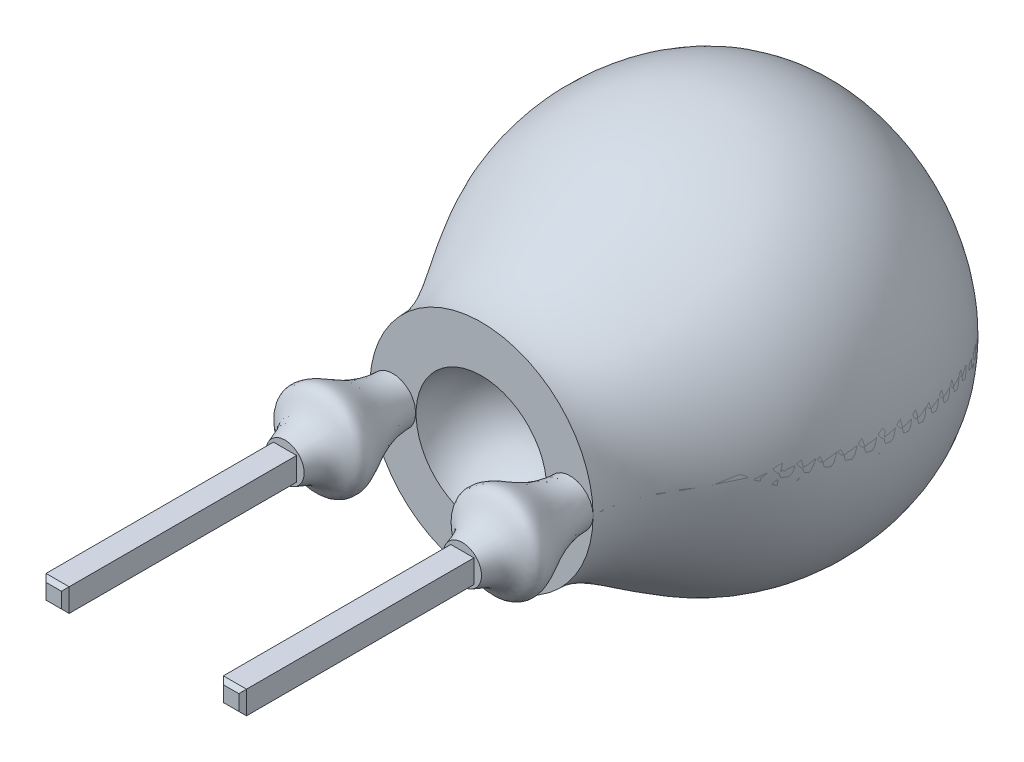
ISO-10303-21;
HEADER;
FILE_DESCRIPTION(('STEP AP214'),'2;1');
FILE_NAME('part.step','',(''),(''),'','','');
FILE_SCHEMA(('AUTOMOTIVE_DESIGN { 1 0 10303 214 1 1 1 1 }'));
ENDSEC;
DATA;
#1=APPLICATION_CONTEXT('core data for automotive mechanical design processes');
#2=APPLICATION_PROTOCOL_DEFINITION('international standard','automotive_design',2000,#1);
#3=PRODUCT_CONTEXT('',#1,'mechanical');
#4=PRODUCT('Part','Part','',(#3));
#5=PRODUCT_RELATED_PRODUCT_CATEGORY('part','',(#4));
#6=PRODUCT_DEFINITION_FORMATION('','',#4);
#7=PRODUCT_DEFINITION_CONTEXT('part definition',#1,'design');
#8=PRODUCT_DEFINITION('design','',#6,#7);
#9=PRODUCT_DEFINITION_SHAPE('','',#8);
#10=(LENGTH_UNIT() NAMED_UNIT(*) SI_UNIT(.MILLI.,.METRE.));
#11=(NAMED_UNIT(*) PLANE_ANGLE_UNIT() SI_UNIT($,.RADIAN.));
#12=(NAMED_UNIT(*) SI_UNIT($,.STERADIAN.) SOLID_ANGLE_UNIT());
#13=UNCERTAINTY_MEASURE_WITH_UNIT(LENGTH_MEASURE(1.E-05),#10,'distance_accuracy_value','');
#14=(GEOMETRIC_REPRESENTATION_CONTEXT(3) GLOBAL_UNCERTAINTY_ASSIGNED_CONTEXT((#13)) GLOBAL_UNIT_ASSIGNED_CONTEXT((#10,
#11,#12)) REPRESENTATION_CONTEXT('',''));
#15=CARTESIAN_POINT('',(0.,0.,0.));
#16=DIRECTION('',(0.,0.,1.));
#17=DIRECTION('',(1.,0.,0.));
#18=AXIS2_PLACEMENT_3D('',#15,#16,#17);
#19=CARTESIAN_POINT('',(0.,0.,-1.39695413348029));
#20=DIRECTION('',(0.,0.,1.));
#21=DIRECTION('',(1.,0.,0.));
#22=AXIS2_PLACEMENT_3D('',#19,#20,#21);
#23=SPHERICAL_SURFACE('',#22,0.847180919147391);
#24=CARTESIAN_POINT('',(0.,0.,-1.39695413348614));
#25=DIRECTION('',(0.,0.,1.));
#26=DIRECTION('',(1.,0.,0.));
#27=AXIS2_PLACEMENT_3D('',#24,#25,#26);
#28=CIRCLE('',#27,0.847180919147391);
#29=CARTESIAN_POINT('',(0.847180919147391,0.,-1.39695413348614));
#30=VERTEX_POINT('',#29);
#31=EDGE_CURVE('E12',#30,#30,#28,.T.);
#32=ORIENTED_EDGE('',*,*,#31,.T.);
#33=EDGE_LOOP('',(#32));
#34=FACE_BOUND('',#33,.T.);
#35=ADVANCED_FACE('F42',(#34),#23,.F.);
#36=CARTESIAN_POINT('',(0.847180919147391,0.,-1.39695413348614));
#37=DIRECTION('',(0.,0.,1.));
#38=DIRECTION('',(1.,0.,0.));
#39=AXIS2_PLACEMENT_3D('',#36,#37,#38);
#40=PLANE('',#39);
#41=CARTESIAN_POINT('',(0.,0.,-1.39695413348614));
#42=DIRECTION('',(0.,0.,1.));
#43=DIRECTION('',(1.,0.,0.));
#44=AXIS2_PLACEMENT_3D('',#41,#42,#43);
#45=CIRCLE('',#44,1.44772172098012);
#46=CARTESIAN_POINT('',(1.44772172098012,0.,-1.39695413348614));
#47=VERTEX_POINT('',#46);
#48=EDGE_CURVE('E48',#47,#47,#45,.T.);
#49=ORIENTED_EDGE('',*,*,#48,.T.);
#50=EDGE_LOOP('',(#49));
#51=FACE_BOUND('',#50,.T.);
#52=ORIENTED_EDGE('',*,*,#31,.F.);
#53=EDGE_LOOP('',(#52));
#54=FACE_BOUND('',#53,.T.);
#55=ADVANCED_FACE('F54',(#51,#54),#40,.T.);
#56=CARTESIAN_POINT('',(1.4477217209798,0.,-1.39695413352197));
#57=CARTESIAN_POINT('',(1.43940707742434,0.,-2.0445928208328));
#58=CARTESIAN_POINT('',(2.86556308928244,0.,-3.35387835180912));
#59=CARTESIAN_POINT('',(2.36238990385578,0.,-6.40949501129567));
#60=CARTESIAN_POINT('',(0.374661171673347,0.,-6.50548745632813));
#61=CARTESIAN_POINT('',(0.,0.,-6.33489721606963));
#62=B_SPLINE_CURVE_WITH_KNOTS('',3,(#56,#57,#58,#59,#60,#61),.UNSPECIFIED.,.F.,.F.,(4,1,1,4),
(0.186847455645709,0.431077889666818,0.786359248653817,1.0320571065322),.UNSPECIFIED.);
#63=CARTESIAN_POINT('',(0.,0.,0.));
#64=DIRECTION('',(0.,0.,1.));
#65=AXIS1_PLACEMENT('',#63,#64);
#66=SURFACE_OF_REVOLUTION('',#62,#65);
#67=CARTESIAN_POINT('',(0.,0.,-6.33489721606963));
#68=VERTEX_POINT('',#67);
#69=VERTEX_LOOP('',#68);
#70=FACE_BOUND('',#69,.T.);
#71=ORIENTED_EDGE('',*,*,#48,.F.);
#72=EDGE_LOOP('',(#71));
#73=FACE_BOUND('',#72,.T.);
#74=ADVANCED_FACE('F51',(#70,#73),#66,.F.);
#75=CLOSED_SHELL('',(#35,#55,#74));
#76=MANIFOLD_SOLID_BREP('B2',#75);
#77=CARTESIAN_POINT('',(1.39739232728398,0.,-0.000164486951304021));
#78=CARTESIAN_POINT('',(1.43186781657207,0.,-0.114042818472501));
#79=CARTESIAN_POINT('',(1.48500321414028,0.,-0.289557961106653));
#80=CARTESIAN_POINT('',(1.85338365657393,0.,-0.449633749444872));
#81=CARTESIAN_POINT('',(0.972106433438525,0.,-1.66585540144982));
#82=CARTESIAN_POINT('',(2.90090916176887,0.,-3.1392324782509));
#83=CARTESIAN_POINT('',(2.46196736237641,0.,-5.80479160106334));
#84=CARTESIAN_POINT('',(1.35485925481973,0.,-6.29118697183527));
#85=CARTESIAN_POINT('',(1.15000000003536,0.,-6.3482408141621));
#86=B_SPLINE_CURVE_WITH_KNOTS('',3,(#77,#78,#79,#80,#81,#82,#83,#84,#85),.UNSPECIFIED.,.F.,.F.,
(4,1,1,1,1,1,4),(0.,0.0420977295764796,0.0648831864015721,0.127474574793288,0.431077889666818,
0.786359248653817,0.864790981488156),.UNSPECIFIED.);
#87=CARTESIAN_POINT('',(1.15000000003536,0.,-0.000164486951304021));
#88=DIRECTION('',(0.,0.,1.));
#89=AXIS1_PLACEMENT('',#87,#88);
#90=SURFACE_OF_REVOLUTION('',#86,#89);
#91=CARTESIAN_POINT('',(0.,0.,-3.24089099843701));
#92=CARTESIAN_POINT('',(0.,0.0332385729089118,-3.24089929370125));
#93=CARTESIAN_POINT('',(0.,0.066534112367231,-3.24429590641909));
#94=CARTESIAN_POINT('',(0.,0.131868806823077,-3.25754081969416));
#95=CARTESIAN_POINT('',(0.,0.163903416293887,-3.26741053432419));
#96=CARTESIAN_POINT('',(0.,0.225373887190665,-3.29255072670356));
#97=CARTESIAN_POINT('',(0.,0.25483229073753,-3.30776689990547));
#98=CARTESIAN_POINT('',(0.,0.310993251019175,-3.34253675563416));
#99=CARTESIAN_POINT('',(0.,0.337695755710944,-3.36209052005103));
#100=CARTESIAN_POINT('',(0.,0.435671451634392,-3.44449524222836));
#101=CARTESIAN_POINT('',(2.72317212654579E-13,0.496703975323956,-3.51982001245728));
#102=CARTESIAN_POINT('',(1.15147209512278E-13,0.564038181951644,-3.62995706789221));
#103=CARTESIAN_POINT('',(0.,0.580315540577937,-3.65971767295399));
#104=CARTESIAN_POINT('',(0.,0.610232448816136,-3.72053435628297));
#105=CARTESIAN_POINT('',(0.,0.623876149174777,-3.75158830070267));
#106=CARTESIAN_POINT('',(0.,0.661049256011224,-3.84627869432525));
#107=CARTESIAN_POINT('',(0.,0.68079879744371,-3.91140658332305));
#108=CARTESIAN_POINT('',(0.,0.711355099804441,-4.04574418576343));
#109=CARTESIAN_POINT('',(0.,0.721872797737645,-4.11501778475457));
#110=CARTESIAN_POINT('',(0.,0.733282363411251,-4.25440514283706));
#111=CARTESIAN_POINT('',(0.,0.734165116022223,-4.3245196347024));
#112=CARTESIAN_POINT('',(0.,0.725410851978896,-4.4786207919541));
#113=CARTESIAN_POINT('',(0.,0.713571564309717,-4.56249286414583));
#114=CARTESIAN_POINT('',(0.,0.674908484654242,-4.72672491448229));
#115=CARTESIAN_POINT('',(0.,0.648113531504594,-4.80709133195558));
#116=CARTESIAN_POINT('',(0.,0.592090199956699,-4.92927130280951));
#117=CARTESIAN_POINT('',(0.,0.56822386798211,-4.97353701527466));
#118=CARTESIAN_POINT('',(0.,0.527691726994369,-5.03684634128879));
#119=CARTESIAN_POINT('',(0.,0.513404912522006,-5.05742008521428));
#120=CARTESIAN_POINT('',(0.,0.483178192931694,-5.09736407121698));
#121=CARTESIAN_POINT('',(2.04297004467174E-13,0.467235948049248,-5.11673254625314));
#122=CARTESIAN_POINT('',(2.85900495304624E-13,0.424510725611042,-5.1641442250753));
#123=CARTESIAN_POINT('',(0.,0.396557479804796,-5.19115712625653));
#124=CARTESIAN_POINT('',(0.,0.336716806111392,-5.24034320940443));
#125=CARTESIAN_POINT('',(0.,0.304838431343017,-5.26252721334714));
#126=CARTESIAN_POINT('',(0.,0.243807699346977,-5.29709874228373));
#127=CARTESIAN_POINT('',(0.,0.215256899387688,-5.31054189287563));
#128=CARTESIAN_POINT('',(0.,0.156311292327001,-5.33250137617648));
#129=CARTESIAN_POINT('',(0.,0.125917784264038,-5.3410211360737));
#130=CARTESIAN_POINT('',(0.,0.0639330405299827,-5.35254009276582));
#131=CARTESIAN_POINT('',(0.,0.0323367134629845,-5.35551233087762));
#132=CARTESIAN_POINT('',(0.,-0.0308629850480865,-5.35560179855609));
#133=CARTESIAN_POINT('',(0.,-0.0624663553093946,-5.35271968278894));
#134=CARTESIAN_POINT('',(0.,-0.122220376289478,-5.34179004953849));
#135=CARTESIAN_POINT('',(0.,-0.150449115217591,-5.33415891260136));
#136=CARTESIAN_POINT('',(0.,-0.205391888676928,-5.31461239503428));
#137=CARTESIAN_POINT('',(0.,-0.232104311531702,-5.30269255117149));
#138=CARTESIAN_POINT('',(0.,-0.291996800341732,-5.2706782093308));
#139=CARTESIAN_POINT('',(0.,-0.324429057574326,-5.24918496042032));
#140=CARTESIAN_POINT('',(0.,-0.385363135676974,-5.2012123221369));
#141=CARTESIAN_POINT('',(0.,-0.413857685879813,-5.17472391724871));
#142=CARTESIAN_POINT('',(0.,-0.47651062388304,-5.10766271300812));
#143=CARTESIAN_POINT('',(0.,-0.508938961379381,-5.06547843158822));
#144=CARTESIAN_POINT('',(0.,-0.566686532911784,-4.97652523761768));
#145=CARTESIAN_POINT('',(3.0412279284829E-13,-0.591993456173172,-4.92974857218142));
#146=CARTESIAN_POINT('',(4.07045563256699E-13,-0.644368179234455,-4.81487685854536));
#147=CARTESIAN_POINT('',(1.08987414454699E-13,-0.668461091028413,-4.74542699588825));
#148=CARTESIAN_POINT('',(-1.09475002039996E-13,-0.705229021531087,-4.60361391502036));
#149=CARTESIAN_POINT('',(0.,-0.717892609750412,-4.53124785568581));
#150=CARTESIAN_POINT('',(0.,-0.732640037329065,-4.38380614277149));
#151=CARTESIAN_POINT('',(0.,-0.734477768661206,-4.3087062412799));
#152=CARTESIAN_POINT('',(0.,-0.727116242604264,-4.15904143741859));
#153=CARTESIAN_POINT('',(0.,-0.717917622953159,-4.08447650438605));
#154=CARTESIAN_POINT('',(0.,-0.689360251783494,-3.94348659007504));
#155=CARTESIAN_POINT('',(0.,-0.670869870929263,-3.87688655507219));
#156=CARTESIAN_POINT('',(0.,-0.623616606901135,-3.74740411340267));
#157=CARTESIAN_POINT('',(0.,-0.594868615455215,-3.6845164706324));
#158=CARTESIAN_POINT('',(0.,-0.53716345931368,-3.5843700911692));
#159=CARTESIAN_POINT('',(0.,-0.511235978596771,-3.54536473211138));
#160=CARTESIAN_POINT('',(0.,-0.453819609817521,-3.47166106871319));
#161=CARTESIAN_POINT('',(2.13741807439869E-13,-0.422339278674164,-3.43695627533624));
#162=CARTESIAN_POINT('',(1.62795538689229E-13,-0.361975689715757,-3.38143885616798));
#163=CARTESIAN_POINT('',(0.,-0.334318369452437,-3.35929928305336));
#164=CARTESIAN_POINT('',(0.,-0.275800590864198,-3.31969948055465));
#165=CARTESIAN_POINT('',(0.,-0.244943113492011,-3.30223494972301));
#166=CARTESIAN_POINT('',(0.,-0.186080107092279,-3.27575621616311));
#167=CARTESIAN_POINT('',(0.,-0.158497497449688,-3.26580504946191));
#168=CARTESIAN_POINT('',(0.,-0.1020895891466,-3.25068132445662));
#169=CARTESIAN_POINT('',(0.,-0.0732679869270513,-3.24549546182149));
#170=CARTESIAN_POINT('',(0.,-0.0295373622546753,-3.24155306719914));
#171=CARTESIAN_POINT('',(0.,-0.0147743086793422,-3.24088731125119));
#172=CARTESIAN_POINT('',(0.,0.,-3.24089099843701));
#173=B_SPLINE_CURVE_WITH_KNOTS('',3,(#91,#92,#93,#94,#95,#96,#97,#98,#99,#100,#101,#102,#103,
#104,#105,#106,#107,#108,#109,#110,#111,#112,#113,#114,#115,#116,#117,#118,#119,#120,#121,#122,
#123,#124,#125,#126,#127,#128,#129,#130,#131,#132,#133,#134,#135,#136,#137,#138,#139,#140,#141,
#142,#143,#144,#145,#146,#147,#148,#149,#150,#151,#152,#153,#154,#155,#156,#157,#158,#159,#160,
#161,#162,#163,#164,#165,#166,#167,#168,#169,#170,#171,#172),.UNSPECIFIED.,.T.,.F.,(4,2,2,2,2,2,
2,2,2,2,2,2,2,2,2,2,2,2,2,2,2,2,2,2,2,2,2,2,2,2,2,2,2,2,2,2,2,2,2,2,4),(0.,0.0996519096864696,
0.199635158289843,0.298630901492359,0.397628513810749,0.68213025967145,0.783908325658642,
0.885524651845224,1.08888489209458,1.29840624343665,1.50812579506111,1.76100398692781,
2.01339623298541,2.1637635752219,2.23883302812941,2.3140100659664,2.43018944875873,
2.54610571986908,2.64038896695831,2.73460650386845,2.82928071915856,2.92394434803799,
3.01129261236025,3.09873204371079,3.21481492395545,3.33110935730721,3.48986020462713,
3.64888382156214,3.86824260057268,4.08782051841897,4.31237148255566,4.53690947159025,
4.74354835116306,4.94988845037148,5.08998986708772,5.22987724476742,5.33579243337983,
5.44160983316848,5.52921891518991,5.61658265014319,5.66087721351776),.UNSPECIFIED.);
#174=CARTESIAN_POINT('',(0.,0.,-3.24089099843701));
#175=VERTEX_POINT('',#174);
#176=EDGE_CURVE('E40',#175,#175,#173,.T.);
#177=ORIENTED_EDGE('',*,*,#176,.F.);
#178=EDGE_LOOP('',(#177));
#179=FACE_BOUND('',#178,.T.);
#180=CARTESIAN_POINT('',(1.15000000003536,0.,-6.3482408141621));
#181=VERTEX_POINT('',#180);
#182=VERTEX_LOOP('',#181);
#183=FACE_BOUND('',#182,.T.);
#184=CARTESIAN_POINT('',(1.15000000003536,0.,-0.00016448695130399));
#185=DIRECTION('',(0.,0.,1.));
#186=DIRECTION('',(1.,0.,0.));
#187=AXIS2_PLACEMENT_3D('',#184,#185,#186);
#188=CIRCLE('',#187,0.247392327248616);
#189=CARTESIAN_POINT('',(1.39739232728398,0.,-0.000164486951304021));
#190=VERTEX_POINT('',#189);
#191=EDGE_CURVE('E114',#190,#190,#188,.T.);
#192=ORIENTED_EDGE('',*,*,#191,.F.);
#193=EDGE_LOOP('',(#192));
#194=FACE_BOUND('',#193,.T.);
#195=ADVANCED_FACE('F102',(#179,#183,#194),#90,.F.);
#196=CARTESIAN_POINT('',(1.39739232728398,0.,-0.000164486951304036));
#197=DIRECTION('',(0.,0.,1.));
#198=DIRECTION('',(1.,0.,0.));
#199=AXIS2_PLACEMENT_3D('',#196,#197,#198);
#200=PLANE('',#199);
#201=ORIENTED_EDGE('',*,*,#191,.T.);
#202=EDGE_LOOP('',(#201));
#203=FACE_BOUND('',#202,.T.);
#204=ADVANCED_FACE('F124',(#203),#200,.T.);
#205=CARTESIAN_POINT('',(-1.39739232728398,0.,-0.000164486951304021));
#206=CARTESIAN_POINT('',(-1.43186781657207,0.,-0.114042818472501));
#207=CARTESIAN_POINT('',(-1.48500321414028,0.,-0.289557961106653));
#208=CARTESIAN_POINT('',(-1.85338365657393,0.,-0.449633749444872));
#209=CARTESIAN_POINT('',(-0.972106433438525,0.,-1.66585540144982));
#210=CARTESIAN_POINT('',(-2.90090916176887,0.,-3.1392324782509));
#211=CARTESIAN_POINT('',(-2.46196736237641,0.,-5.80479160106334));
#212=CARTESIAN_POINT('',(-1.35485925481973,0.,-6.29118697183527));
#213=CARTESIAN_POINT('',(-1.15000000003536,0.,-6.3482408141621));
#214=B_SPLINE_CURVE_WITH_KNOTS('',3,(#205,#206,#207,#208,#209,#210,#211,#212,#213),
.UNSPECIFIED.,.F.,.F.,(4,1,1,1,1,1,4),(0.,0.0420977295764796,0.0648831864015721,
0.127474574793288,0.431077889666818,0.786359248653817,0.864790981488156),.UNSPECIFIED.);
#215=CARTESIAN_POINT('',(-1.15000000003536,0.,-0.000164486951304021));
#216=DIRECTION('',(0.,0.,1.));
#217=AXIS1_PLACEMENT('',#215,#216);
#218=SURFACE_OF_REVOLUTION('',#214,#217);
#219=ORIENTED_EDGE('',*,*,#176,.T.);
#220=EDGE_LOOP('',(#219));
#221=FACE_BOUND('',#220,.T.);
#222=CARTESIAN_POINT('',(-1.15000000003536,0.,-6.3482408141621));
#223=VERTEX_POINT('',#222);
#224=VERTEX_LOOP('',#223);
#225=FACE_BOUND('',#224,.T.);
#226=CARTESIAN_POINT('',(-1.15000000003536,0.,-0.00016448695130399));
#227=DIRECTION('',(0.,0.,-1.));
#228=DIRECTION('',(-1.,0.,0.));
#229=AXIS2_PLACEMENT_3D('',#226,#227,#228);
#230=CIRCLE('',#229,0.247392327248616);
#231=CARTESIAN_POINT('',(-1.39739232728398,0.,-0.000164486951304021));
#232=VERTEX_POINT('',#231);
#233=EDGE_CURVE('E128',#232,#232,#230,.T.);
#234=ORIENTED_EDGE('',*,*,#233,.T.);
#235=EDGE_LOOP('',(#234));
#236=FACE_BOUND('',#235,.T.);
#237=ADVANCED_FACE('F120',(#221,#225,#236),#218,.F.);
#238=CARTESIAN_POINT('',(-1.39739232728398,0.,-0.000164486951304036));
#239=DIRECTION('',(0.,0.,1.));
#240=DIRECTION('',(-1.,0.,0.));
#241=AXIS2_PLACEMENT_3D('',#238,#239,#240);
#242=PLANE('',#241);
#243=ORIENTED_EDGE('',*,*,#233,.F.);
#244=EDGE_LOOP('',(#243));
#245=FACE_BOUND('',#244,.T.);
#246=ADVANCED_FACE('F123',(#245),#242,.T.);
#247=CLOSED_SHELL('',(#195,#204,#237,#246));
#248=MANIFOLD_SOLID_BREP('B6',#247);
#249=CARTESIAN_POINT('',(-1.3,0.15,3.));
#250=DIRECTION('',(1.,0.,0.));
#251=DIRECTION('',(0.,0.,-1.));
#252=AXIS2_PLACEMENT_3D('',#249,#250,#251);
#253=PLANE('',#252);
#254=DIRECTION('',(0.,0.,-1.));
#255=VECTOR('',#254,1.);
#256=CARTESIAN_POINT('',(-1.3,-0.15,3.));
#257=LINE('',#256,#255);
#258=CARTESIAN_POINT('',(-1.3,-0.15,2.95));
#259=VERTEX_POINT('',#258);
#260=CARTESIAN_POINT('',(-1.3,-0.15,0.));
#261=VERTEX_POINT('',#260);
#262=EDGE_CURVE('E244',#259,#261,#257,.T.);
#263=ORIENTED_EDGE('',*,*,#262,.F.);
#264=DIRECTION('',(0.,1.,0.));
#265=VECTOR('',#264,1.);
#266=CARTESIAN_POINT('',(-1.3,0.15,2.95));
#267=LINE('',#266,#265);
#268=CARTESIAN_POINT('',(-1.3,0.15,2.95));
#269=VERTEX_POINT('',#268);
#270=EDGE_CURVE('E239',#259,#269,#267,.T.);
#271=ORIENTED_EDGE('',*,*,#270,.T.);
#272=DIRECTION('',(0.,0.,-1.));
#273=VECTOR('',#272,1.);
#274=CARTESIAN_POINT('',(-1.3,0.15,3.));
#275=LINE('',#274,#273);
#276=CARTESIAN_POINT('',(-1.3,0.15,0.));
#277=VERTEX_POINT('',#276);
#278=EDGE_CURVE('E242',#269,#277,#275,.T.);
#279=ORIENTED_EDGE('',*,*,#278,.T.);
#280=DIRECTION('',(0.,-1.,0.));
#281=VECTOR('',#280,1.);
#282=CARTESIAN_POINT('',(-1.3,0.15,0.));
#283=LINE('',#282,#281);
#284=EDGE_CURVE('E258',#277,#261,#283,.T.);
#285=ORIENTED_EDGE('',*,*,#284,.T.);
#286=EDGE_LOOP('',(#263,#271,#279,#285));
#287=FACE_BOUND('',#286,.T.);
#288=ADVANCED_FACE('F191',(#287),#253,.F.);
#289=CARTESIAN_POINT('',(-1.3,-0.15,3.));
#290=DIRECTION('',(0.,1.,0.));
#291=DIRECTION('',(0.,0.,1.));
#292=AXIS2_PLACEMENT_3D('',#289,#290,#291);
#293=PLANE('',#292);
#294=DIRECTION('',(0.,0.,-1.));
#295=VECTOR('',#294,1.);
#296=CARTESIAN_POINT('',(-1.,-0.15,3.));
#297=LINE('',#296,#295);
#298=CARTESIAN_POINT('',(-1.,-0.15,2.95));
#299=VERTEX_POINT('',#298);
#300=CARTESIAN_POINT('',(-1.,-0.15,0.));
#301=VERTEX_POINT('',#300);
#302=EDGE_CURVE('E276',#299,#301,#297,.T.);
#303=ORIENTED_EDGE('',*,*,#302,.F.);
#304=DIRECTION('',(-1.,0.,0.));
#305=VECTOR('',#304,1.);
#306=CARTESIAN_POINT('',(-1.3,-0.15,2.95));
#307=LINE('',#306,#305);
#308=EDGE_CURVE('E279',#299,#259,#307,.T.);
#309=ORIENTED_EDGE('',*,*,#308,.T.);
#310=ORIENTED_EDGE('',*,*,#262,.T.);
#311=DIRECTION('',(1.,0.,0.));
#312=VECTOR('',#311,1.);
#313=CARTESIAN_POINT('',(-1.3,-0.15,0.));
#314=LINE('',#313,#312);
#315=EDGE_CURVE('E208',#261,#301,#314,.T.);
#316=ORIENTED_EDGE('',*,*,#315,.T.);
#317=EDGE_LOOP('',(#303,#309,#310,#316));
#318=FACE_BOUND('',#317,.T.);
#319=ADVANCED_FACE('F311',(#318),#293,.F.);
#320=CARTESIAN_POINT('',(-1.,0.15,3.));
#321=DIRECTION('',(-1.,0.,0.));
#322=DIRECTION('',(0.,0.,1.));
#323=AXIS2_PLACEMENT_3D('',#320,#321,#322);
#324=PLANE('',#323);
#325=DIRECTION('',(0.,0.,-1.));
#326=VECTOR('',#325,1.);
#327=CARTESIAN_POINT('',(-1.,0.15,3.));
#328=LINE('',#327,#326);
#329=CARTESIAN_POINT('',(-1.,0.15,2.95));
#330=VERTEX_POINT('',#329);
#331=CARTESIAN_POINT('',(-1.,0.15,0.));
#332=VERTEX_POINT('',#331);
#333=EDGE_CURVE('E271',#330,#332,#328,.T.);
#334=ORIENTED_EDGE('',*,*,#333,.F.);
#335=DIRECTION('',(0.,-1.,0.));
#336=VECTOR('',#335,1.);
#337=CARTESIAN_POINT('',(-1.,-0.15,2.95));
#338=LINE('',#337,#336);
#339=EDGE_CURVE('E281',#330,#299,#338,.T.);
#340=ORIENTED_EDGE('',*,*,#339,.T.);
#341=ORIENTED_EDGE('',*,*,#302,.T.);
#342=DIRECTION('',(0.,1.,0.));
#343=VECTOR('',#342,1.);
#344=CARTESIAN_POINT('',(-1.,0.15,0.));
#345=LINE('',#344,#343);
#346=EDGE_CURVE('E272',#301,#332,#345,.T.);
#347=ORIENTED_EDGE('',*,*,#346,.T.);
#348=EDGE_LOOP('',(#334,#340,#341,#347));
#349=FACE_BOUND('',#348,.T.);
#350=ADVANCED_FACE('F310',(#349),#324,.F.);
#351=CARTESIAN_POINT('',(-1.3,0.15,3.));
#352=DIRECTION('',(0.,-1.,0.));
#353=DIRECTION('',(0.,0.,-1.));
#354=AXIS2_PLACEMENT_3D('',#351,#352,#353);
#355=PLANE('',#354);
#356=ORIENTED_EDGE('',*,*,#278,.F.);
#357=DIRECTION('',(1.,0.,0.));
#358=VECTOR('',#357,1.);
#359=CARTESIAN_POINT('',(-1.,0.15,2.95));
#360=LINE('',#359,#358);
#361=EDGE_CURVE('E254',#269,#330,#360,.T.);
#362=ORIENTED_EDGE('',*,*,#361,.T.);
#363=ORIENTED_EDGE('',*,*,#333,.T.);
#364=DIRECTION('',(-1.,0.,0.));
#365=VECTOR('',#364,1.);
#366=CARTESIAN_POINT('',(-1.3,0.15,0.));
#367=LINE('',#366,#365);
#368=EDGE_CURVE('E257',#332,#277,#367,.T.);
#369=ORIENTED_EDGE('',*,*,#368,.T.);
#370=EDGE_LOOP('',(#356,#362,#363,#369));
#371=FACE_BOUND('',#370,.T.);
#372=ADVANCED_FACE('F251',(#371),#355,.F.);
#373=CARTESIAN_POINT('',(-1.3,-0.15,3.));
#374=DIRECTION('',(0.,0.,1.));
#375=DIRECTION('',(1.,0.,0.));
#376=AXIS2_PLACEMENT_3D('',#373,#374,#375);
#377=PLANE('',#376);
#378=DIRECTION('',(1.,0.,0.));
#379=VECTOR('',#378,1.);
#380=CARTESIAN_POINT('',(-1.,-0.1,3.));
#381=LINE('',#380,#379);
#382=CARTESIAN_POINT('',(-1.25,-0.1,3.));
#383=VERTEX_POINT('',#382);
#384=CARTESIAN_POINT('',(-1.05,-0.1,3.));
#385=VERTEX_POINT('',#384);
#386=EDGE_CURVE('E288',#383,#385,#381,.T.);
#387=ORIENTED_EDGE('',*,*,#386,.T.);
#388=DIRECTION('',(0.,1.,0.));
#389=VECTOR('',#388,1.);
#390=CARTESIAN_POINT('',(-1.05,0.15,3.));
#391=LINE('',#390,#389);
#392=CARTESIAN_POINT('',(-1.05,0.1,3.));
#393=VERTEX_POINT('',#392);
#394=EDGE_CURVE('E284',#385,#393,#391,.T.);
#395=ORIENTED_EDGE('',*,*,#394,.T.);
#396=DIRECTION('',(-1.,0.,0.));
#397=VECTOR('',#396,1.);
#398=CARTESIAN_POINT('',(-1.3,0.1,3.));
#399=LINE('',#398,#397);
#400=CARTESIAN_POINT('',(-1.25,0.1,3.));
#401=VERTEX_POINT('',#400);
#402=EDGE_CURVE('E287',#393,#401,#399,.T.);
#403=ORIENTED_EDGE('',*,*,#402,.T.);
#404=DIRECTION('',(0.,-1.,0.));
#405=VECTOR('',#404,1.);
#406=CARTESIAN_POINT('',(-1.25,-0.15,3.));
#407=LINE('',#406,#405);
#408=EDGE_CURVE('E264',#401,#383,#407,.T.);
#409=ORIENTED_EDGE('',*,*,#408,.T.);
#410=EDGE_LOOP('',(#387,#395,#403,#409));
#411=FACE_BOUND('',#410,.T.);
#412=ADVANCED_FACE('F327',(#411),#377,.T.);
#413=CARTESIAN_POINT('',(-1.25,-0.15,3.));
#414=DIRECTION('',(-0.70710678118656,0.,0.707106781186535));
#415=DIRECTION('',(0.707106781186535,0.,0.70710678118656));
#416=AXIS2_PLACEMENT_3D('',#413,#414,#415);
#417=PLANE('',#416);
#418=DIRECTION('',(0.577350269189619,-0.577350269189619,0.577350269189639));
#419=VECTOR('',#418,1.);
#420=CARTESIAN_POINT('',(-1.26666666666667,0.116666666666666,2.98333333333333));
#421=LINE('',#420,#419);
#422=EDGE_CURVE('E262',#269,#401,#421,.T.);
#423=ORIENTED_EDGE('',*,*,#422,.F.);
#424=ORIENTED_EDGE('',*,*,#270,.F.);
#425=DIRECTION('',(0.577350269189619,0.577350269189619,0.577350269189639));
#426=VECTOR('',#425,1.);
#427=CARTESIAN_POINT('',(-1.26666666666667,-0.116666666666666,2.98333333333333));
#428=LINE('',#427,#426);
#429=EDGE_CURVE('E267',#383,#259,#428,.F.);
#430=ORIENTED_EDGE('',*,*,#429,.F.);
#431=ORIENTED_EDGE('',*,*,#408,.F.);
#432=EDGE_LOOP('',(#423,#424,#430,#431));
#433=FACE_BOUND('',#432,.T.);
#434=ADVANCED_FACE('F263',(#433),#417,.T.);
#435=CARTESIAN_POINT('',(-1.3,-0.1,3.));
#436=DIRECTION('',(0.,-0.70710678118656,0.707106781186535));
#437=DIRECTION('',(0.,-0.707106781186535,-0.70710678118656));
#438=AXIS2_PLACEMENT_3D('',#435,#436,#437);
#439=PLANE('',#438);
#440=ORIENTED_EDGE('',*,*,#429,.T.);
#441=ORIENTED_EDGE('',*,*,#308,.F.);
#442=DIRECTION('',(-0.577350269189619,0.577350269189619,0.577350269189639));
#443=VECTOR('',#442,1.);
#444=CARTESIAN_POINT('',(-1.13333333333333,-0.0166666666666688,3.08333333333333));
#445=LINE('',#444,#443);
#446=EDGE_CURVE('E200',#385,#299,#445,.F.);
#447=ORIENTED_EDGE('',*,*,#446,.F.);
#448=ORIENTED_EDGE('',*,*,#386,.F.);
#449=EDGE_LOOP('',(#440,#441,#447,#448));
#450=FACE_BOUND('',#449,.T.);
#451=ADVANCED_FACE('F306',(#450),#439,.T.);
#452=CARTESIAN_POINT('',(-1.3,0.1,3.));
#453=DIRECTION('',(0.,0.70710678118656,0.707106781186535));
#454=DIRECTION('',(0.,-0.707106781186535,0.70710678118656));
#455=AXIS2_PLACEMENT_3D('',#452,#453,#454);
#456=PLANE('',#455);
#457=ORIENTED_EDGE('',*,*,#422,.T.);
#458=ORIENTED_EDGE('',*,*,#402,.F.);
#459=DIRECTION('',(0.577350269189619,0.577350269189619,-0.577350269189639));
#460=VECTOR('',#459,1.);
#461=CARTESIAN_POINT('',(-1.13333333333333,0.0166666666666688,3.08333333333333));
#462=LINE('',#461,#460);
#463=EDGE_CURVE('E100',#330,#393,#462,.F.);
#464=ORIENTED_EDGE('',*,*,#463,.F.);
#465=ORIENTED_EDGE('',*,*,#361,.F.);
#466=EDGE_LOOP('',(#457,#458,#464,#465));
#467=FACE_BOUND('',#466,.T.);
#468=ADVANCED_FACE('F270',(#467),#456,.T.);
#469=CARTESIAN_POINT('',(-1.05,-0.15,3.));
#470=DIRECTION('',(0.70710678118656,0.,0.707106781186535));
#471=DIRECTION('',(0.707106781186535,0.,-0.70710678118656));
#472=AXIS2_PLACEMENT_3D('',#469,#470,#471);
#473=PLANE('',#472);
#474=ORIENTED_EDGE('',*,*,#446,.T.);
#475=ORIENTED_EDGE('',*,*,#339,.F.);
#476=ORIENTED_EDGE('',*,*,#463,.T.);
#477=ORIENTED_EDGE('',*,*,#394,.F.);
#478=EDGE_LOOP('',(#474,#475,#476,#477));
#479=FACE_BOUND('',#478,.T.);
#480=ADVANCED_FACE('F303',(#479),#473,.T.);
#481=CARTESIAN_POINT('',(0.,0.,0.));
#482=DIRECTION('',(0.,0.,-1.));
#483=DIRECTION('',(-1.,0.,0.));
#484=AXIS2_PLACEMENT_3D('',#481,#482,#483);
#485=PLANE('',#484);
#486=ORIENTED_EDGE('',*,*,#284,.F.);
#487=ORIENTED_EDGE('',*,*,#368,.F.);
#488=ORIENTED_EDGE('',*,*,#346,.F.);
#489=ORIENTED_EDGE('',*,*,#315,.F.);
#490=EDGE_LOOP('',(#486,#487,#488,#489));
#491=FACE_BOUND('',#490,.T.);
#492=ADVANCED_FACE('F193',(#491),#485,.T.);
#493=CLOSED_SHELL('',(#288,#319,#350,#372,#412,#434,#451,#468,#480,#492));
#494=MANIFOLD_SOLID_BREP('B34',#493);
#495=CARTESIAN_POINT('',(1.,0.15,3.));
#496=DIRECTION('',(0.,0.,1.));
#497=DIRECTION('',(1.,0.,0.));
#498=AXIS2_PLACEMENT_3D('',#495,#496,#497);
#499=PLANE('',#498);
#500=DIRECTION('',(1.,0.,0.));
#501=VECTOR('',#500,1.);
#502=CARTESIAN_POINT('',(1.3,-0.1,3.));
#503=LINE('',#502,#501);
#504=CARTESIAN_POINT('',(1.05,-0.1,3.));
#505=VERTEX_POINT('',#504);
#506=CARTESIAN_POINT('',(1.25,-0.1,3.));
#507=VERTEX_POINT('',#506);
#508=EDGE_CURVE('E482',#505,#507,#503,.T.);
#509=ORIENTED_EDGE('',*,*,#508,.T.);
#510=DIRECTION('',(0.,1.,0.));
#511=VECTOR('',#510,1.);
#512=CARTESIAN_POINT('',(1.25,0.15,3.));
#513=LINE('',#512,#511);
#514=CARTESIAN_POINT('',(1.25,0.100000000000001,3.));
#515=VERTEX_POINT('',#514);
#516=EDGE_CURVE('E484',#507,#515,#513,.T.);
#517=ORIENTED_EDGE('',*,*,#516,.T.);
#518=DIRECTION('',(-1.,0.,0.));
#519=VECTOR('',#518,1.);
#520=CARTESIAN_POINT('',(1.,0.100000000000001,3.));
#521=LINE('',#520,#519);
#522=CARTESIAN_POINT('',(1.05,0.100000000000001,3.));
#523=VERTEX_POINT('',#522);
#524=EDGE_CURVE('E478',#515,#523,#521,.T.);
#525=ORIENTED_EDGE('',*,*,#524,.T.);
#526=DIRECTION('',(0.,-1.,0.));
#527=VECTOR('',#526,1.);
#528=CARTESIAN_POINT('',(1.05,-0.15,3.));
#529=LINE('',#528,#527);
#530=EDGE_CURVE('E480',#523,#505,#529,.T.);
#531=ORIENTED_EDGE('',*,*,#530,.T.);
#532=EDGE_LOOP('',(#509,#517,#525,#531));
#533=FACE_BOUND('',#532,.T.);
#534=ADVANCED_FACE('F395',(#533),#499,.T.);
#535=CARTESIAN_POINT('',(1.,0.100000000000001,3.));
#536=DIRECTION('',(0.,0.70710678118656,0.707106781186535));
#537=DIRECTION('',(0.,-0.707106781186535,0.70710678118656));
#538=AXIS2_PLACEMENT_3D('',#535,#536,#537);
#539=PLANE('',#538);
#540=DIRECTION('',(0.57735026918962,-0.577350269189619,0.577350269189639));
#541=VECTOR('',#540,1.);
#542=CARTESIAN_POINT('',(1.03333333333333,0.116666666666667,2.98333333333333));
#543=LINE('',#542,#541);
#544=CARTESIAN_POINT('',(1.,0.15,2.95));
#545=VERTEX_POINT('',#544);
#546=EDGE_CURVE('E505',#545,#523,#543,.T.);
#547=ORIENTED_EDGE('',*,*,#546,.T.);
#548=ORIENTED_EDGE('',*,*,#524,.F.);
#549=DIRECTION('',(0.577350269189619,0.57735026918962,-0.577350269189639));
#550=VECTOR('',#549,1.);
#551=CARTESIAN_POINT('',(1.16666666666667,0.0166666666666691,3.08333333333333));
#552=LINE('',#551,#550);
#553=CARTESIAN_POINT('',(1.3,0.15,2.95));
#554=VERTEX_POINT('',#553);
#555=EDGE_CURVE('E498',#554,#515,#552,.F.);
#556=ORIENTED_EDGE('',*,*,#555,.F.);
#557=DIRECTION('',(1.,0.,0.));
#558=VECTOR('',#557,1.);
#559=CARTESIAN_POINT('',(1.3,0.15,2.95));
#560=LINE('',#559,#558);
#561=EDGE_CURVE('E189',#545,#554,#560,.T.);
#562=ORIENTED_EDGE('',*,*,#561,.F.);
#563=EDGE_LOOP('',(#547,#548,#556,#562));
#564=FACE_BOUND('',#563,.T.);
#565=ADVANCED_FACE('F503',(#564),#539,.T.);
#566=CARTESIAN_POINT('',(1.05,0.15,3.));
#567=DIRECTION('',(-0.70710678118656,0.,0.707106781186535));
#568=DIRECTION('',(0.707106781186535,0.,0.70710678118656));
#569=AXIS2_PLACEMENT_3D('',#566,#567,#568);
#570=PLANE('',#569);
#571=ORIENTED_EDGE('',*,*,#546,.F.);
#572=DIRECTION('',(0.,1.,0.));
#573=VECTOR('',#572,1.);
#574=CARTESIAN_POINT('',(1.,0.15,2.95));
#575=LINE('',#574,#573);
#576=CARTESIAN_POINT('',(1.,-0.15,2.95));
#577=VERTEX_POINT('',#576);
#578=EDGE_CURVE('E403',#577,#545,#575,.T.);
#579=ORIENTED_EDGE('',*,*,#578,.F.);
#580=DIRECTION('',(0.577350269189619,0.577350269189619,0.57735026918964));
#581=VECTOR('',#580,1.);
#582=CARTESIAN_POINT('',(1.13333333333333,-0.0166666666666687,3.08333333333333));
#583=LINE('',#582,#581);
#584=EDGE_CURVE('E507',#505,#577,#583,.F.);
#585=ORIENTED_EDGE('',*,*,#584,.F.);
#586=ORIENTED_EDGE('',*,*,#530,.F.);
#587=EDGE_LOOP('',(#571,#579,#585,#586));
#588=FACE_BOUND('',#587,.T.);
#589=ADVANCED_FACE('F515',(#588),#570,.T.);
#590=CARTESIAN_POINT('',(1.,-0.1,3.));
#591=DIRECTION('',(0.,-0.70710678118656,0.707106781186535));
#592=DIRECTION('',(0.,-0.707106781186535,-0.70710678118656));
#593=AXIS2_PLACEMENT_3D('',#590,#591,#592);
#594=PLANE('',#593);
#595=ORIENTED_EDGE('',*,*,#584,.T.);
#596=DIRECTION('',(-1.,0.,0.));
#597=VECTOR('',#596,1.);
#598=CARTESIAN_POINT('',(1.,-0.15,2.95));
#599=LINE('',#598,#597);
#600=CARTESIAN_POINT('',(1.3,-0.15,2.95));
#601=VERTEX_POINT('',#600);
#602=EDGE_CURVE('E417',#601,#577,#599,.T.);
#603=ORIENTED_EDGE('',*,*,#602,.F.);
#604=DIRECTION('',(-0.57735026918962,0.577350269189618,0.577350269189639));
#605=VECTOR('',#604,1.);
#606=CARTESIAN_POINT('',(1.16666666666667,-0.0166666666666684,3.08333333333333));
#607=LINE('',#606,#605);
#608=EDGE_CURVE('E496',#507,#601,#607,.F.);
#609=ORIENTED_EDGE('',*,*,#608,.F.);
#610=ORIENTED_EDGE('',*,*,#508,.F.);
#611=EDGE_LOOP('',(#595,#603,#609,#610));
#612=FACE_BOUND('',#611,.T.);
#613=ADVANCED_FACE('F517',(#612),#594,.T.);
#614=CARTESIAN_POINT('',(1.25,0.150000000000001,3.));
#615=DIRECTION('',(0.70710678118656,0.,0.707106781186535));
#616=DIRECTION('',(0.707106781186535,0.,-0.70710678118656));
#617=AXIS2_PLACEMENT_3D('',#614,#615,#616);
#618=PLANE('',#617);
#619=ORIENTED_EDGE('',*,*,#608,.T.);
#620=DIRECTION('',(0.,-1.,0.));
#621=VECTOR('',#620,1.);
#622=CARTESIAN_POINT('',(1.3,-0.15,2.95));
#623=LINE('',#622,#621);
#624=EDGE_CURVE('E464',#554,#601,#623,.T.);
#625=ORIENTED_EDGE('',*,*,#624,.F.);
#626=ORIENTED_EDGE('',*,*,#555,.T.);
#627=ORIENTED_EDGE('',*,*,#516,.F.);
#628=EDGE_LOOP('',(#619,#625,#626,#627));
#629=FACE_BOUND('',#628,.T.);
#630=ADVANCED_FACE('F495',(#629),#618,.T.);
#631=CARTESIAN_POINT('',(1.3,0.15,3.));
#632=DIRECTION('',(-1.,0.,0.));
#633=DIRECTION('',(0.,-1.,0.));
#634=AXIS2_PLACEMENT_3D('',#631,#632,#633);
#635=PLANE('',#634);
#636=DIRECTION('',(0.,0.,-1.));
#637=VECTOR('',#636,1.);
#638=CARTESIAN_POINT('',(1.3,0.15,3.));
#639=LINE('',#638,#637);
#640=CARTESIAN_POINT('',(1.3,0.15,0.));
#641=VERTEX_POINT('',#640);
#642=EDGE_CURVE('E458',#554,#641,#639,.T.);
#643=ORIENTED_EDGE('',*,*,#642,.F.);
#644=ORIENTED_EDGE('',*,*,#624,.T.);
#645=DIRECTION('',(0.,0.,-1.));
#646=VECTOR('',#645,1.);
#647=CARTESIAN_POINT('',(1.3,-0.15,3.));
#648=LINE('',#647,#646);
#649=CARTESIAN_POINT('',(1.3,-0.15,0.));
#650=VERTEX_POINT('',#649);
#651=EDGE_CURVE('E461',#601,#650,#648,.T.);
#652=ORIENTED_EDGE('',*,*,#651,.T.);
#653=DIRECTION('',(0.,1.,0.));
#654=VECTOR('',#653,1.);
#655=CARTESIAN_POINT('',(1.3,0.15,0.));
#656=LINE('',#655,#654);
#657=EDGE_CURVE('E448',#650,#641,#656,.T.);
#658=ORIENTED_EDGE('',*,*,#657,.T.);
#659=EDGE_LOOP('',(#643,#644,#652,#658));
#660=FACE_BOUND('',#659,.T.);
#661=ADVANCED_FACE('F462',(#660),#635,.F.);
#662=CARTESIAN_POINT('',(1.3,-0.15,3.));
#663=DIRECTION('',(0.,1.,0.));
#664=DIRECTION('',(-1.,0.,0.));
#665=AXIS2_PLACEMENT_3D('',#662,#663,#664);
#666=PLANE('',#665);
#667=ORIENTED_EDGE('',*,*,#651,.F.);
#668=ORIENTED_EDGE('',*,*,#602,.T.);
#669=DIRECTION('',(0.,0.,-1.));
#670=VECTOR('',#669,1.);
#671=CARTESIAN_POINT('',(1.,-0.15,3.));
#672=LINE('',#671,#670);
#673=CARTESIAN_POINT('',(1.,-0.15,0.));
#674=VERTEX_POINT('',#673);
#675=EDGE_CURVE('E465',#577,#674,#672,.T.);
#676=ORIENTED_EDGE('',*,*,#675,.T.);
#677=DIRECTION('',(1.,0.,0.));
#678=VECTOR('',#677,1.);
#679=CARTESIAN_POINT('',(1.3,-0.15,0.));
#680=LINE('',#679,#678);
#681=EDGE_CURVE('E452',#674,#650,#680,.T.);
#682=ORIENTED_EDGE('',*,*,#681,.T.);
#683=EDGE_LOOP('',(#667,#668,#676,#682));
#684=FACE_BOUND('',#683,.T.);
#685=ADVANCED_FACE('F467',(#684),#666,.F.);
#686=CARTESIAN_POINT('',(1.,0.15,3.));
#687=DIRECTION('',(1.,0.,0.));
#688=DIRECTION('',(0.,1.,0.));
#689=AXIS2_PLACEMENT_3D('',#686,#687,#688);
#690=PLANE('',#689);
#691=ORIENTED_EDGE('',*,*,#675,.F.);
#692=ORIENTED_EDGE('',*,*,#578,.T.);
#693=DIRECTION('',(0.,0.,-1.));
#694=VECTOR('',#693,1.);
#695=CARTESIAN_POINT('',(1.,0.15,3.));
#696=LINE('',#695,#694);
#697=CARTESIAN_POINT('',(1.,0.15,0.));
#698=VERTEX_POINT('',#697);
#699=EDGE_CURVE('E476',#545,#698,#696,.T.);
#700=ORIENTED_EDGE('',*,*,#699,.T.);
#701=DIRECTION('',(0.,-1.,0.));
#702=VECTOR('',#701,1.);
#703=CARTESIAN_POINT('',(1.,0.15,0.));
#704=LINE('',#703,#702);
#705=EDGE_CURVE('E469',#698,#674,#704,.T.);
#706=ORIENTED_EDGE('',*,*,#705,.T.);
#707=EDGE_LOOP('',(#691,#692,#700,#706));
#708=FACE_BOUND('',#707,.T.);
#709=ADVANCED_FACE('F513',(#708),#690,.F.);
#710=CARTESIAN_POINT('',(1.3,0.15,3.));
#711=DIRECTION('',(0.,-1.,0.));
#712=DIRECTION('',(1.,0.,0.));
#713=AXIS2_PLACEMENT_3D('',#710,#711,#712);
#714=PLANE('',#713);
#715=ORIENTED_EDGE('',*,*,#699,.F.);
#716=ORIENTED_EDGE('',*,*,#561,.T.);
#717=ORIENTED_EDGE('',*,*,#642,.T.);
#718=DIRECTION('',(-1.,0.,0.));
#719=VECTOR('',#718,1.);
#720=CARTESIAN_POINT('',(1.3,0.15,0.));
#721=LINE('',#720,#719);
#722=EDGE_CURVE('E454',#641,#698,#721,.T.);
#723=ORIENTED_EDGE('',*,*,#722,.T.);
#724=EDGE_LOOP('',(#715,#716,#717,#723));
#725=FACE_BOUND('',#724,.T.);
#726=ADVANCED_FACE('F397',(#725),#714,.F.);
#727=CARTESIAN_POINT('',(0.,0.,0.));
#728=DIRECTION('',(0.,0.,-1.));
#729=DIRECTION('',(-1.,0.,0.));
#730=AXIS2_PLACEMENT_3D('',#727,#728,#729);
#731=PLANE('',#730);
#732=ORIENTED_EDGE('',*,*,#722,.F.);
#733=ORIENTED_EDGE('',*,*,#657,.F.);
#734=ORIENTED_EDGE('',*,*,#681,.F.);
#735=ORIENTED_EDGE('',*,*,#705,.F.);
#736=EDGE_LOOP('',(#732,#733,#734,#735));
#737=FACE_BOUND('',#736,.T.);
#738=ADVANCED_FACE('F450',(#737),#731,.T.);
#739=CLOSED_SHELL('',(#534,#565,#589,#613,#630,#661,#685,#709,#726,#738));
#740=MANIFOLD_SOLID_BREP('B94',#739);
#741=ADVANCED_BREP_SHAPE_REPRESENTATION('',(#18,#76,#248,#494,#740),#14);
#742=SHAPE_DEFINITION_REPRESENTATION(#9,#741);
ENDSEC;
END-ISO-10303-21;
